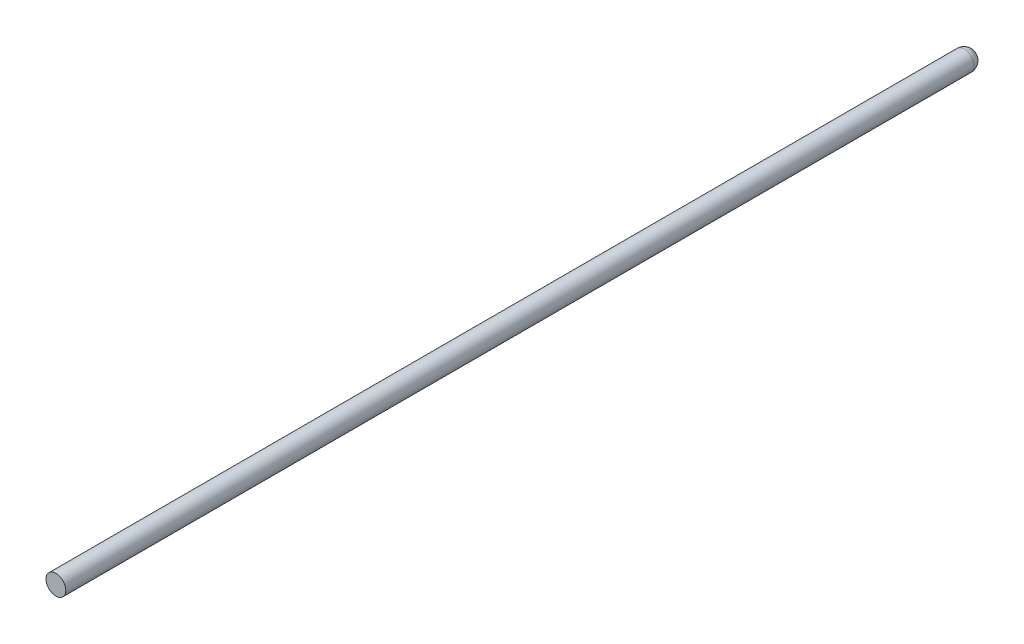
from build123d import *

# Parameters (mm, degrees)
ESQUISSE1_R        = 7
BOSS_EXTRU_1_DEPTH = 650
CONG_1_R           = 7


with BuildPart() as part:
    # Esquisse1 → Boss.-Extru.1 (new body)
    with BuildSketch(Plane.XY):
        Circle(ESQUISSE1_R)
    extrude(amount=BOSS_EXTRU_1_DEPTH)

    # Cong_1
    cong_1_edges = [part.edges().sort_by_distance(p)[0] for p in [
        (-7, 0, 0),
    ]]
    fillet(cong_1_edges, radius=CONG_1_R)


solid = part.part
